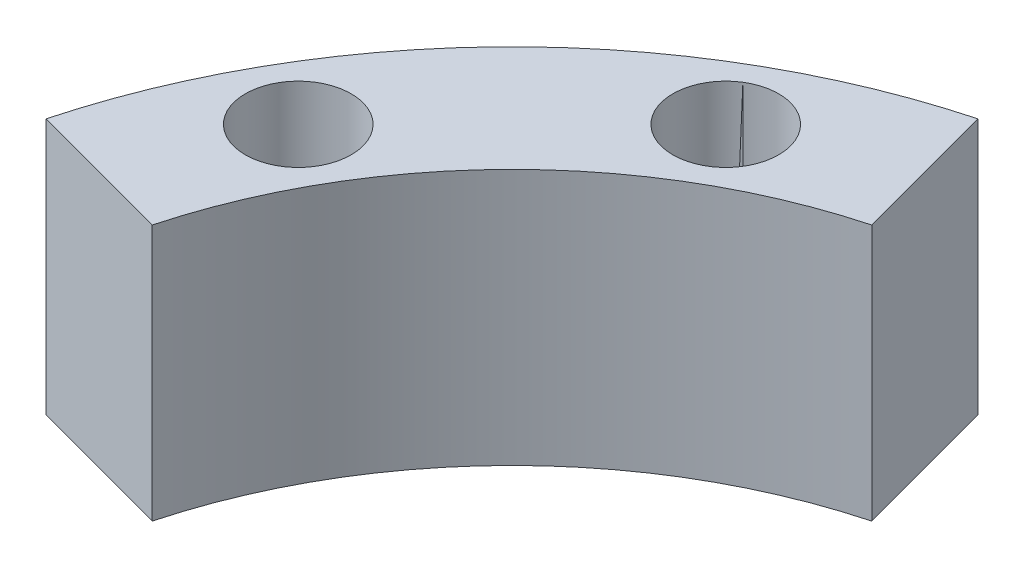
from build123d import *

# Parameters (mm, degrees)
SKETCH1_R          = 3.302
EXTRUDE1_DEPTH     = 16
CUT_EXTRUDE1_DEPTH = 3
CUT_EXTRUDE2_DEPTH = 3


with BuildPart() as part:
    # Sketch1 → Extrude1 (new body)
    with BuildSketch(Plane(origin=(0, 0, 0), x_dir=(1, 0, 0), z_dir=(0, 1, 0))):
        with BuildLine():
            Line((-39.718869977, 10.642639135), (-30.668144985, 8.217504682))
            ThreePointArc((-30.668144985, 8.217504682), (-22.450640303, 22.450640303), (-8.217504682, 30.668144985))
            Line((-8.217504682, 30.668144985), (-10.642639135, 39.718869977))
            ThreePointArc((-10.642639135, 39.718869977), (-29.076230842, 29.076230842), (-39.718869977, 10.642639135))
        make_face()
        with Locations(Location((-31.55476142, 18.21815, 0), (0, 0, 270))):
            Circle(SKETCH1_R, mode=Mode.SUBTRACT)
        with Locations(Location((-18.21815, 31.55476142, 0), (0, 0, 270))):
            Circle(SKETCH1_R, mode=Mode.SUBTRACT)
    extrude(amount=EXTRUDE1_DEPTH)

    # Sketch2 → Cut-Revolve1 (revolve, cut)
    with BuildSketch(Plane(origin=(-7.880705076, 0, 7.880705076), x_dir=(0.7071067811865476, 0, 0.7071067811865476), z_dir=(-0.7071067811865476, 0, 0.7071067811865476)), mode=Mode.PRIVATE) as cut_revolve1_sk:
        with BuildLine():
            Line((-39.148333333, 8), (-39.148333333, 7.373451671))
            ThreePointArc((-39.148333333, 7.373451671), (-38.92325905, 6.830074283), (-38.379881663, 6.605))
            Line((-38.379881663, 6.605), (-41.12, 6.605))
            Line((-41.12, 6.605), (-41.12, 8))
            Line((-41.12, 8), (-39.148333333, 8))
        make_face()
    revolve(cut_revolve1_sk.sketch.rotate(Axis((-36.956935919, 8, -21.195525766), (0.7071067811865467, 0, 0.7071067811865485)), 90), axis=Axis((-36.956935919, 8, -21.195525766), (0.7071067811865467, 0, 0.7071067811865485)), mode=Mode.SUBTRACT)

    # Sketch3 → Cut-Revolve2 (revolve, cut)
    with BuildSketch(Plane(origin=(7.880705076, 0, -7.880705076), x_dir=(0.7071067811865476, 0, 0.7071067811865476), z_dir=(-0.7071067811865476, 0, 0.7071067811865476)), mode=Mode.PRIVATE) as cut_revolve2_sk:
        with BuildLine():
            Line((-39.148333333, 8), (-39.148333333, 7.373451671))
            ThreePointArc((-39.148333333, 7.373451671), (-38.92325905, 6.830074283), (-38.379881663, 6.605))
            Line((-38.379881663, 6.605), (-41.12, 6.605))
            Line((-41.12, 6.605), (-41.12, 8))
            Line((-41.12, 8), (-39.148333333, 8))
        make_face()
    revolve(cut_revolve2_sk.sketch.rotate(Axis((-21.195525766, 8, -36.956935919), (0.7071067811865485, 0, 0.7071067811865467)), 90), axis=Axis((-21.195525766, 8, -36.956935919), (0.7071067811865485, 0, 0.7071067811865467)), mode=Mode.SUBTRACT)

    # Sketch4 → Cut-Extrude1 (cut)
    with BuildSketch(Plane(origin=(-27.682051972, 0, -27.682051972), x_dir=(0.7071067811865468, 0, -0.7071067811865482), z_dir=(0.7071067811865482, 0, 0.7071067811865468))):
        Polygon((10.43, 8.412805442), (10.43, 7.587194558), (11.145, 7.174389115), (11.86, 7.587194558), (11.86, 8.412805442), (11.145, 8.825610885), align=None)
    extrude(amount=CUT_EXTRUDE1_DEPTH, mode=Mode.SUBTRACT)

    # Sketch5 → Cut-Extrude2 (cut)
    with BuildSketch(Plane(origin=(-27.682051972, 0, -27.682051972), x_dir=(0.7071067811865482, 0, -0.7071067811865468), z_dir=(0.7071067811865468, 0, 0.7071067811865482))):
        Polygon((-11.86, 8.412805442), (-11.86, 7.587194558), (-11.145, 7.174389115), (-10.43, 7.587194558), (-10.43, 8.412805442), (-11.145, 8.825610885), align=None)
    extrude(amount=CUT_EXTRUDE2_DEPTH, mode=Mode.SUBTRACT)


solid = part.part
